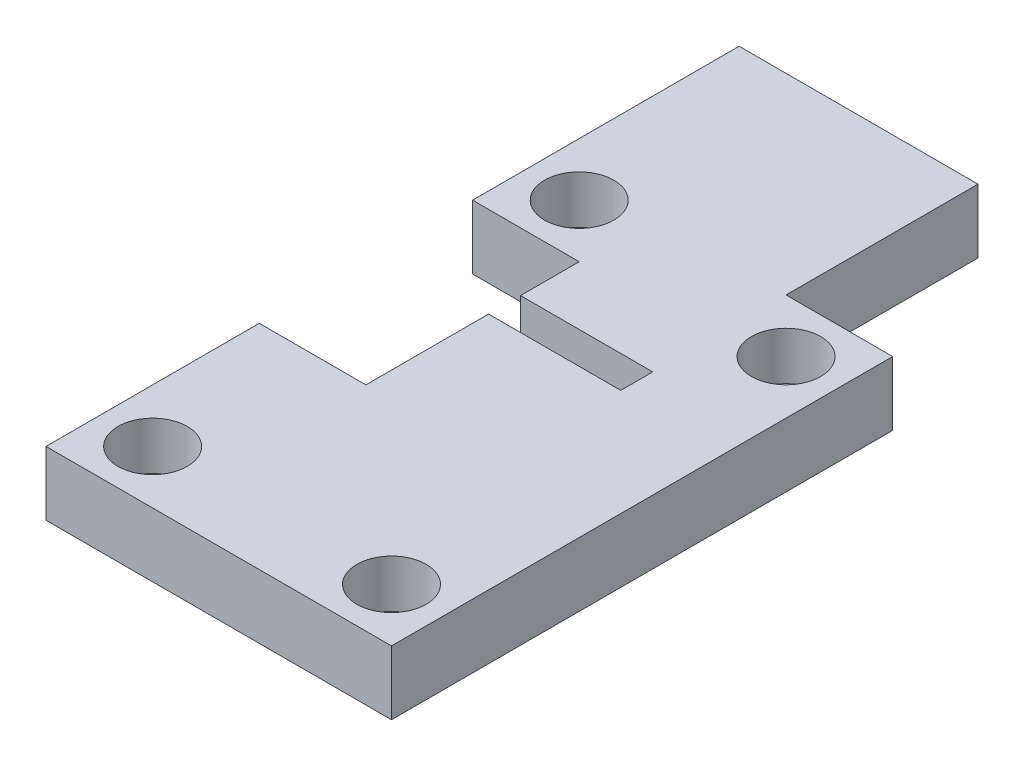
ISO-10303-21;
HEADER;
FILE_DESCRIPTION(('STEP AP214'),'2;1');
FILE_NAME('part.step','',(''),(''),'','','');
FILE_SCHEMA(('AUTOMOTIVE_DESIGN { 1 0 10303 214 1 1 1 1 }'));
ENDSEC;
DATA;
#1=APPLICATION_CONTEXT('core data for automotive mechanical design processes');
#2=APPLICATION_PROTOCOL_DEFINITION('international standard','automotive_design',2000,#1);
#3=PRODUCT_CONTEXT('',#1,'mechanical');
#4=PRODUCT('Part','Part','',(#3));
#5=PRODUCT_RELATED_PRODUCT_CATEGORY('part','',(#4));
#6=PRODUCT_DEFINITION_FORMATION('','',#4);
#7=PRODUCT_DEFINITION_CONTEXT('part definition',#1,'design');
#8=PRODUCT_DEFINITION('design','',#6,#7);
#9=PRODUCT_DEFINITION_SHAPE('','',#8);
#10=(LENGTH_UNIT() NAMED_UNIT(*) SI_UNIT(.MILLI.,.METRE.));
#11=(NAMED_UNIT(*) PLANE_ANGLE_UNIT() SI_UNIT($,.RADIAN.));
#12=(NAMED_UNIT(*) SI_UNIT($,.STERADIAN.) SOLID_ANGLE_UNIT());
#13=UNCERTAINTY_MEASURE_WITH_UNIT(LENGTH_MEASURE(1.E-05),#10,'distance_accuracy_value','');
#14=(GEOMETRIC_REPRESENTATION_CONTEXT(3) GLOBAL_UNCERTAINTY_ASSIGNED_CONTEXT((#13)) GLOBAL_UNIT_ASSIGNED_CONTEXT((#10,
#11,#12)) REPRESENTATION_CONTEXT('',''));
#15=CARTESIAN_POINT('',(0.,0.,0.));
#16=DIRECTION('',(0.,0.,1.));
#17=DIRECTION('',(1.,0.,0.));
#18=AXIS2_PLACEMENT_3D('',#15,#16,#17);
#19=CARTESIAN_POINT('',(5.,-59.,20.));
#20=DIRECTION('',(0.,1.,0.));
#21=DIRECTION('',(0.,0.,1.));
#22=AXIS2_PLACEMENT_3D('',#19,#20,#21);
#23=CYLINDRICAL_SURFACE('',#22,1.75);
#24=CARTESIAN_POINT('',(5.,0.,20.));
#25=DIRECTION('',(0.,1.,0.));
#26=DIRECTION('',(0.,0.,1.));
#27=AXIS2_PLACEMENT_3D('',#24,#25,#26);
#28=CIRCLE('',#27,1.75);
#29=CARTESIAN_POINT('',(5.,0.,21.75));
#30=VERTEX_POINT('',#29);
#31=EDGE_CURVE('E260',#30,#30,#28,.T.);
#32=ORIENTED_EDGE('',*,*,#31,.F.);
#33=EDGE_LOOP('',(#32));
#34=FACE_BOUND('',#33,.T.);
#35=CARTESIAN_POINT('',(5.,1.5,20.));
#36=DIRECTION('',(0.,1.,0.));
#37=DIRECTION('',(0.,0.,1.));
#38=AXIS2_PLACEMENT_3D('',#35,#36,#37);
#39=CIRCLE('',#38,1.75);
#40=CARTESIAN_POINT('',(5.,1.5,21.75));
#41=VERTEX_POINT('',#40);
#42=EDGE_CURVE('E37',#41,#41,#39,.F.);
#43=ORIENTED_EDGE('',*,*,#42,.F.);
#44=EDGE_LOOP('',(#43));
#45=FACE_BOUND('',#44,.T.);
#46=ADVANCED_FACE('F33',(#34,#45),#23,.F.);
#47=CARTESIAN_POINT('',(5.,-59.,60.));
#48=DIRECTION('',(0.,1.,0.));
#49=DIRECTION('',(0.,0.,1.));
#50=AXIS2_PLACEMENT_3D('',#47,#48,#49);
#51=CYLINDRICAL_SURFACE('',#50,1.75);
#52=CARTESIAN_POINT('',(5.,0.,60.));
#53=DIRECTION('',(0.,1.,0.));
#54=DIRECTION('',(0.,0.,1.));
#55=AXIS2_PLACEMENT_3D('',#52,#53,#54);
#56=CIRCLE('',#55,1.75);
#57=CARTESIAN_POINT('',(5.,0.,61.75));
#58=VERTEX_POINT('',#57);
#59=EDGE_CURVE('E263',#58,#58,#56,.T.);
#60=ORIENTED_EDGE('',*,*,#59,.F.);
#61=EDGE_LOOP('',(#60));
#62=FACE_BOUND('',#61,.T.);
#63=CARTESIAN_POINT('',(5.,1.5,60.));
#64=DIRECTION('',(0.,1.,0.));
#65=DIRECTION('',(0.,0.,1.));
#66=AXIS2_PLACEMENT_3D('',#63,#64,#65);
#67=CIRCLE('',#66,1.75);
#68=CARTESIAN_POINT('',(5.,1.5,61.75));
#69=VERTEX_POINT('',#68);
#70=EDGE_CURVE('E182',#69,#69,#67,.F.);
#71=ORIENTED_EDGE('',*,*,#70,.F.);
#72=EDGE_LOOP('',(#71));
#73=FACE_BOUND('',#72,.T.);
#74=ADVANCED_FACE('F345',(#62,#73),#51,.F.);
#75=CARTESIAN_POINT('',(27.4000000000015,-59.,60.));
#76=DIRECTION('',(0.,1.,0.));
#77=DIRECTION('',(0.,0.,1.));
#78=AXIS2_PLACEMENT_3D('',#75,#76,#77);
#79=CYLINDRICAL_SURFACE('',#78,1.75);
#80=CARTESIAN_POINT('',(27.4000000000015,0.,60.));
#81=DIRECTION('',(0.,1.,0.));
#82=DIRECTION('',(0.,0.,1.));
#83=AXIS2_PLACEMENT_3D('',#80,#81,#82);
#84=CIRCLE('',#83,1.75);
#85=CARTESIAN_POINT('',(27.4000000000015,0.,61.75));
#86=VERTEX_POINT('',#85);
#87=EDGE_CURVE('E266',#86,#86,#84,.T.);
#88=ORIENTED_EDGE('',*,*,#87,.F.);
#89=EDGE_LOOP('',(#88));
#90=FACE_BOUND('',#89,.T.);
#91=CARTESIAN_POINT('',(27.4000000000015,1.5,60.));
#92=DIRECTION('',(0.,1.,0.));
#93=DIRECTION('',(0.,0.,1.));
#94=AXIS2_PLACEMENT_3D('',#91,#92,#93);
#95=CIRCLE('',#94,1.75);
#96=CARTESIAN_POINT('',(27.4000000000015,1.5,61.75));
#97=VERTEX_POINT('',#96);
#98=EDGE_CURVE('E178',#97,#97,#95,.F.);
#99=ORIENTED_EDGE('',*,*,#98,.F.);
#100=EDGE_LOOP('',(#99));
#101=FACE_BOUND('',#100,.T.);
#102=ADVANCED_FACE('F351',(#90,#101),#79,.F.);
#103=CARTESIAN_POINT('',(27.4000000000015,-59.,23.));
#104=DIRECTION('',(0.,1.,0.));
#105=DIRECTION('',(0.,0.,1.));
#106=AXIS2_PLACEMENT_3D('',#103,#104,#105);
#107=CYLINDRICAL_SURFACE('',#106,1.75);
#108=CARTESIAN_POINT('',(27.4000000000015,0.,23.));
#109=DIRECTION('',(0.,1.,0.));
#110=DIRECTION('',(0.,0.,1.));
#111=AXIS2_PLACEMENT_3D('',#108,#109,#110);
#112=CIRCLE('',#111,1.75);
#113=CARTESIAN_POINT('',(27.4000000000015,0.,24.75));
#114=VERTEX_POINT('',#113);
#115=EDGE_CURVE('E269',#114,#114,#112,.T.);
#116=ORIENTED_EDGE('',*,*,#115,.F.);
#117=EDGE_LOOP('',(#116));
#118=FACE_BOUND('',#117,.T.);
#119=CARTESIAN_POINT('',(27.4000000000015,1.5,23.));
#120=DIRECTION('',(0.,1.,0.));
#121=DIRECTION('',(0.,0.,1.));
#122=AXIS2_PLACEMENT_3D('',#119,#120,#121);
#123=CIRCLE('',#122,1.75);
#124=CARTESIAN_POINT('',(27.4000000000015,1.5,24.75));
#125=VERTEX_POINT('',#124);
#126=EDGE_CURVE('E147',#125,#125,#123,.F.);
#127=ORIENTED_EDGE('',*,*,#126,.F.);
#128=EDGE_LOOP('',(#127));
#129=FACE_BOUND('',#128,.T.);
#130=ADVANCED_FACE('F359',(#118,#129),#107,.F.);
#131=CARTESIAN_POINT('',(0.,0.,65.));
#132=DIRECTION('',(1.,0.,0.));
#133=DIRECTION('',(0.,0.,-1.));
#134=AXIS2_PLACEMENT_3D('',#131,#132,#133);
#135=PLANE('',#134);
#136=DIRECTION('',(0.,1.,0.));
#137=VECTOR('',#136,1.);
#138=CARTESIAN_POINT('',(0.,-59.,45.));
#139=LINE('',#138,#137);
#140=CARTESIAN_POINT('',(0.,0.,45.));
#141=VERTEX_POINT('',#140);
#142=CARTESIAN_POINT('',(0.,6.,45.));
#143=VERTEX_POINT('',#142);
#144=EDGE_CURVE('E225',#141,#143,#139,.T.);
#145=ORIENTED_EDGE('',*,*,#144,.F.);
#146=DIRECTION('',(0.,0.,-1.));
#147=VECTOR('',#146,1.);
#148=CARTESIAN_POINT('',(0.,0.,65.));
#149=LINE('',#148,#147);
#150=CARTESIAN_POINT('',(0.,0.,65.));
#151=VERTEX_POINT('',#150);
#152=EDGE_CURVE('E42',#151,#141,#149,.T.);
#153=ORIENTED_EDGE('',*,*,#152,.F.);
#154=DIRECTION('',(0.,-1.,0.));
#155=VECTOR('',#154,1.);
#156=CARTESIAN_POINT('',(0.,0.,65.));
#157=LINE('',#156,#155);
#158=CARTESIAN_POINT('',(0.,6.,65.));
#159=VERTEX_POINT('',#158);
#160=EDGE_CURVE('E273',#159,#151,#157,.T.);
#161=ORIENTED_EDGE('',*,*,#160,.F.);
#162=DIRECTION('',(0.,0.,-1.));
#163=VECTOR('',#162,1.);
#164=CARTESIAN_POINT('',(0.,6.,65.));
#165=LINE('',#164,#163);
#166=EDGE_CURVE('E164',#159,#143,#165,.T.);
#167=ORIENTED_EDGE('',*,*,#166,.T.);
#168=EDGE_LOOP('',(#145,#153,#161,#167));
#169=FACE_BOUND('',#168,.T.);
#170=ADVANCED_FACE('F35',(#169),#135,.F.);
#171=DIRECTION('',(0.,1.,0.));
#172=VECTOR('',#171,1.);
#173=CARTESIAN_POINT('',(0.,-59.,25.));
#174=LINE('',#173,#172);
#175=CARTESIAN_POINT('',(0.,0.,25.));
#176=VERTEX_POINT('',#175);
#177=CARTESIAN_POINT('',(0.,6.,25.));
#178=VERTEX_POINT('',#177);
#179=EDGE_CURVE('E239',#176,#178,#174,.T.);
#180=ORIENTED_EDGE('',*,*,#179,.T.);
#181=CARTESIAN_POINT('',(0.,6.,0.));
#182=VERTEX_POINT('',#181);
#183=EDGE_CURVE('E169',#178,#182,#165,.T.);
#184=ORIENTED_EDGE('',*,*,#183,.T.);
#185=DIRECTION('',(0.,-1.,0.));
#186=VECTOR('',#185,1.);
#187=CARTESIAN_POINT('',(0.,0.,0.));
#188=LINE('',#187,#186);
#189=CARTESIAN_POINT('',(0.,0.,0.));
#190=VERTEX_POINT('',#189);
#191=EDGE_CURVE('E272',#182,#190,#188,.T.);
#192=ORIENTED_EDGE('',*,*,#191,.T.);
#193=EDGE_CURVE('E166',#176,#190,#149,.T.);
#194=ORIENTED_EDGE('',*,*,#193,.F.);
#195=EDGE_LOOP('',(#180,#184,#192,#194));
#196=FACE_BOUND('',#195,.T.);
#197=ADVANCED_FACE('F295',(#196),#135,.F.);
#198=CARTESIAN_POINT('',(0.,0.,65.));
#199=DIRECTION('',(0.,1.,0.));
#200=DIRECTION('',(0.,0.,1.));
#201=AXIS2_PLACEMENT_3D('',#198,#199,#200);
#202=PLANE('',#201);
#203=ORIENTED_EDGE('',*,*,#31,.T.);
#204=EDGE_LOOP('',(#203));
#205=FACE_BOUND('',#204,.T.);
#206=ORIENTED_EDGE('',*,*,#59,.T.);
#207=EDGE_LOOP('',(#206));
#208=FACE_BOUND('',#207,.T.);
#209=ORIENTED_EDGE('',*,*,#87,.T.);
#210=EDGE_LOOP('',(#209));
#211=FACE_BOUND('',#210,.T.);
#212=ORIENTED_EDGE('',*,*,#115,.T.);
#213=EDGE_LOOP('',(#212));
#214=FACE_BOUND('',#213,.T.);
#215=DIRECTION('',(-1.,0.,0.));
#216=VECTOR('',#215,1.);
#217=CARTESIAN_POINT('',(0.,0.,45.));
#218=LINE('',#217,#216);
#219=CARTESIAN_POINT('',(10.,0.,45.));
#220=VERTEX_POINT('',#219);
#221=EDGE_CURVE('E258',#220,#141,#218,.T.);
#222=ORIENTED_EDGE('',*,*,#221,.F.);
#223=DIRECTION('',(0.,0.,1.));
#224=VECTOR('',#223,1.);
#225=CARTESIAN_POINT('',(10.,0.,65.));
#226=LINE('',#225,#224);
#227=CARTESIAN_POINT('',(10.,0.,33.5000000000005));
#228=VERTEX_POINT('',#227);
#229=EDGE_CURVE('E256',#228,#220,#226,.T.);
#230=ORIENTED_EDGE('',*,*,#229,.F.);
#231=DIRECTION('',(-1.,0.,0.));
#232=VECTOR('',#231,1.);
#233=CARTESIAN_POINT('',(-1.14575687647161E-12,0.,33.5000000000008));
#234=LINE('',#233,#232);
#235=CARTESIAN_POINT('',(22.4000000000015,0.,33.5));
#236=VERTEX_POINT('',#235);
#237=EDGE_CURVE('E254',#236,#228,#234,.T.);
#238=ORIENTED_EDGE('',*,*,#237,.F.);
#239=DIRECTION('',(0.,0.,1.));
#240=VECTOR('',#239,1.);
#241=CARTESIAN_POINT('',(22.4000000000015,0.,65.));
#242=LINE('',#241,#240);
#243=CARTESIAN_POINT('',(22.4000000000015,0.,30.5));
#244=VERTEX_POINT('',#243);
#245=EDGE_CURVE('E252',#244,#236,#242,.T.);
#246=ORIENTED_EDGE('',*,*,#245,.F.);
#247=DIRECTION('',(1.,0.,0.));
#248=VECTOR('',#247,1.);
#249=CARTESIAN_POINT('',(0.,0.,30.5));
#250=LINE('',#249,#248);
#251=CARTESIAN_POINT('',(10.,0.,30.5));
#252=VERTEX_POINT('',#251);
#253=EDGE_CURVE('E250',#252,#244,#250,.T.);
#254=ORIENTED_EDGE('',*,*,#253,.F.);
#255=DIRECTION('',(0.,0.,1.));
#256=VECTOR('',#255,1.);
#257=CARTESIAN_POINT('',(10.,0.,65.));
#258=LINE('',#257,#256);
#259=CARTESIAN_POINT('',(10.,0.,25.));
#260=VERTEX_POINT('',#259);
#261=EDGE_CURVE('E248',#260,#252,#258,.T.);
#262=ORIENTED_EDGE('',*,*,#261,.F.);
#263=DIRECTION('',(1.,0.,0.));
#264=VECTOR('',#263,1.);
#265=CARTESIAN_POINT('',(0.,0.,25.));
#266=LINE('',#265,#264);
#267=EDGE_CURVE('E246',#176,#260,#266,.T.);
#268=ORIENTED_EDGE('',*,*,#267,.F.);
#269=ORIENTED_EDGE('',*,*,#193,.T.);
#270=DIRECTION('',(1.,0.,0.));
#271=VECTOR('',#270,1.);
#272=CARTESIAN_POINT('',(0.,0.,0.));
#273=LINE('',#272,#271);
#274=CARTESIAN_POINT('',(22.4000000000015,0.,0.));
#275=VERTEX_POINT('',#274);
#276=EDGE_CURVE('E284',#190,#275,#273,.T.);
#277=ORIENTED_EDGE('',*,*,#276,.T.);
#278=DIRECTION('',(0.,0.,-1.));
#279=VECTOR('',#278,1.);
#280=CARTESIAN_POINT('',(22.4000000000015,0.,65.));
#281=LINE('',#280,#279);
#282=CARTESIAN_POINT('',(22.4000000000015,0.,18.));
#283=VERTEX_POINT('',#282);
#284=EDGE_CURVE('E58',#283,#275,#281,.T.);
#285=ORIENTED_EDGE('',*,*,#284,.F.);
#286=DIRECTION('',(-1.,0.,0.));
#287=VECTOR('',#286,1.);
#288=CARTESIAN_POINT('',(0.,0.,18.));
#289=LINE('',#288,#287);
#290=CARTESIAN_POINT('',(32.4000000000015,0.,18.));
#291=VERTEX_POINT('',#290);
#292=EDGE_CURVE('E244',#291,#283,#289,.T.);
#293=ORIENTED_EDGE('',*,*,#292,.F.);
#294=DIRECTION('',(0.,0.,-1.));
#295=VECTOR('',#294,1.);
#296=CARTESIAN_POINT('',(32.4000000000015,0.,65.));
#297=LINE('',#296,#295);
#298=CARTESIAN_POINT('',(32.4000000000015,0.,65.));
#299=VERTEX_POINT('',#298);
#300=EDGE_CURVE('E157',#299,#291,#297,.T.);
#301=ORIENTED_EDGE('',*,*,#300,.F.);
#302=DIRECTION('',(1.,0.,0.));
#303=VECTOR('',#302,1.);
#304=CARTESIAN_POINT('',(0.,0.,65.));
#305=LINE('',#304,#303);
#306=EDGE_CURVE('E276',#151,#299,#305,.T.);
#307=ORIENTED_EDGE('',*,*,#306,.F.);
#308=ORIENTED_EDGE('',*,*,#152,.T.);
#309=EDGE_LOOP('',(#222,#230,#238,#246,#254,#262,#268,#269,#277,#285,#293,#301,#307,#308));
#310=FACE_BOUND('',#309,.T.);
#311=ADVANCED_FACE('F302',(#205,#208,#211,#214,#310),#202,.F.);
#312=CARTESIAN_POINT('',(32.4000000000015,0.,65.));
#313=DIRECTION('',(-1.,0.,0.));
#314=DIRECTION('',(0.,0.,1.));
#315=AXIS2_PLACEMENT_3D('',#312,#313,#314);
#316=PLANE('',#315);
#317=DIRECTION('',(0.,1.,0.));
#318=VECTOR('',#317,1.);
#319=CARTESIAN_POINT('',(32.4000000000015,-59.,18.));
#320=LINE('',#319,#318);
#321=CARTESIAN_POINT('',(32.4000000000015,6.,18.));
#322=VERTEX_POINT('',#321);
#323=EDGE_CURVE('E139',#291,#322,#320,.T.);
#324=ORIENTED_EDGE('',*,*,#323,.T.);
#325=DIRECTION('',(0.,0.,-1.));
#326=VECTOR('',#325,1.);
#327=CARTESIAN_POINT('',(32.4000000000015,6.,65.));
#328=LINE('',#327,#326);
#329=CARTESIAN_POINT('',(32.4000000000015,6.,65.));
#330=VERTEX_POINT('',#329);
#331=EDGE_CURVE('E154',#330,#322,#328,.T.);
#332=ORIENTED_EDGE('',*,*,#331,.F.);
#333=DIRECTION('',(0.,1.,0.));
#334=VECTOR('',#333,1.);
#335=CARTESIAN_POINT('',(32.4000000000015,0.,65.));
#336=LINE('',#335,#334);
#337=EDGE_CURVE('E279',#299,#330,#336,.T.);
#338=ORIENTED_EDGE('',*,*,#337,.F.);
#339=ORIENTED_EDGE('',*,*,#300,.T.);
#340=EDGE_LOOP('',(#324,#332,#338,#339));
#341=FACE_BOUND('',#340,.T.);
#342=ADVANCED_FACE('F152',(#341),#316,.F.);
#343=CARTESIAN_POINT('',(0.,6.,65.));
#344=DIRECTION('',(0.,-1.,0.));
#345=DIRECTION('',(0.,0.,-1.));
#346=AXIS2_PLACEMENT_3D('',#343,#344,#345);
#347=PLANE('',#346);
#348=CARTESIAN_POINT('',(5.,6.,20.));
#349=DIRECTION('',(0.,1.,0.));
#350=DIRECTION('',(0.,0.,1.));
#351=AXIS2_PLACEMENT_3D('',#348,#349,#350);
#352=CIRCLE('',#351,3.25);
#353=CARTESIAN_POINT('',(5.,6.,23.25));
#354=VERTEX_POINT('',#353);
#355=EDGE_CURVE('E198',#354,#354,#352,.T.);
#356=ORIENTED_EDGE('',*,*,#355,.F.);
#357=EDGE_LOOP('',(#356));
#358=FACE_BOUND('',#357,.T.);
#359=CARTESIAN_POINT('',(5.,6.,60.));
#360=DIRECTION('',(0.,1.,0.));
#361=DIRECTION('',(0.,0.,1.));
#362=AXIS2_PLACEMENT_3D('',#359,#360,#361);
#363=CIRCLE('',#362,3.25);
#364=CARTESIAN_POINT('',(5.,6.,63.25));
#365=VERTEX_POINT('',#364);
#366=EDGE_CURVE('E191',#365,#365,#363,.T.);
#367=ORIENTED_EDGE('',*,*,#366,.F.);
#368=EDGE_LOOP('',(#367));
#369=FACE_BOUND('',#368,.T.);
#370=CARTESIAN_POINT('',(27.4000000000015,6.,60.));
#371=DIRECTION('',(0.,1.,0.));
#372=DIRECTION('',(0.,0.,1.));
#373=AXIS2_PLACEMENT_3D('',#370,#371,#372);
#374=CIRCLE('',#373,3.25);
#375=CARTESIAN_POINT('',(27.4000000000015,6.,63.25));
#376=VERTEX_POINT('',#375);
#377=EDGE_CURVE('E184',#376,#376,#374,.T.);
#378=ORIENTED_EDGE('',*,*,#377,.F.);
#379=EDGE_LOOP('',(#378));
#380=FACE_BOUND('',#379,.T.);
#381=CARTESIAN_POINT('',(27.4000000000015,6.,23.));
#382=DIRECTION('',(0.,1.,0.));
#383=DIRECTION('',(0.,0.,1.));
#384=AXIS2_PLACEMENT_3D('',#381,#382,#383);
#385=CIRCLE('',#384,3.25);
#386=CARTESIAN_POINT('',(27.4000000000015,6.,26.25));
#387=VERTEX_POINT('',#386);
#388=EDGE_CURVE('E180',#387,#387,#385,.T.);
#389=ORIENTED_EDGE('',*,*,#388,.F.);
#390=EDGE_LOOP('',(#389));
#391=FACE_BOUND('',#390,.T.);
#392=DIRECTION('',(-1.,0.,0.));
#393=VECTOR('',#392,1.);
#394=CARTESIAN_POINT('',(0.,6.,45.));
#395=LINE('',#394,#393);
#396=CARTESIAN_POINT('',(10.,6.,45.));
#397=VERTEX_POINT('',#396);
#398=EDGE_CURVE('E158',#397,#143,#395,.T.);
#399=ORIENTED_EDGE('',*,*,#398,.T.);
#400=ORIENTED_EDGE('',*,*,#166,.F.);
#401=DIRECTION('',(-1.,0.,0.));
#402=VECTOR('',#401,1.);
#403=CARTESIAN_POINT('',(0.,6.,65.));
#404=LINE('',#403,#402);
#405=EDGE_CURVE('E163',#330,#159,#404,.T.);
#406=ORIENTED_EDGE('',*,*,#405,.F.);
#407=ORIENTED_EDGE('',*,*,#331,.T.);
#408=DIRECTION('',(-1.,0.,0.));
#409=VECTOR('',#408,1.);
#410=CARTESIAN_POINT('',(22.4000000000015,6.,18.));
#411=LINE('',#410,#409);
#412=CARTESIAN_POINT('',(22.4000000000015,6.,18.));
#413=VERTEX_POINT('',#412);
#414=EDGE_CURVE('E136',#322,#413,#411,.T.);
#415=ORIENTED_EDGE('',*,*,#414,.T.);
#416=DIRECTION('',(0.,0.,-1.));
#417=VECTOR('',#416,1.);
#418=CARTESIAN_POINT('',(22.4000000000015,6.,0.));
#419=LINE('',#418,#417);
#420=CARTESIAN_POINT('',(22.4000000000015,6.,0.));
#421=VERTEX_POINT('',#420);
#422=EDGE_CURVE('E146',#413,#421,#419,.T.);
#423=ORIENTED_EDGE('',*,*,#422,.T.);
#424=DIRECTION('',(-1.,0.,0.));
#425=VECTOR('',#424,1.);
#426=CARTESIAN_POINT('',(0.,6.,0.));
#427=LINE('',#426,#425);
#428=EDGE_CURVE('E277',#421,#182,#427,.T.);
#429=ORIENTED_EDGE('',*,*,#428,.T.);
#430=ORIENTED_EDGE('',*,*,#183,.F.);
#431=DIRECTION('',(1.,0.,0.));
#432=VECTOR('',#431,1.);
#433=CARTESIAN_POINT('',(0.,6.,25.));
#434=LINE('',#433,#432);
#435=CARTESIAN_POINT('',(10.,6.,25.));
#436=VERTEX_POINT('',#435);
#437=EDGE_CURVE('E208',#178,#436,#434,.T.);
#438=ORIENTED_EDGE('',*,*,#437,.T.);
#439=DIRECTION('',(0.,0.,1.));
#440=VECTOR('',#439,1.);
#441=CARTESIAN_POINT('',(10.,6.,30.5));
#442=LINE('',#441,#440);
#443=CARTESIAN_POINT('',(10.,6.,30.5));
#444=VERTEX_POINT('',#443);
#445=EDGE_CURVE('E50',#436,#444,#442,.T.);
#446=ORIENTED_EDGE('',*,*,#445,.T.);
#447=DIRECTION('',(1.,0.,0.));
#448=VECTOR('',#447,1.);
#449=CARTESIAN_POINT('',(10.,6.,30.5));
#450=LINE('',#449,#448);
#451=CARTESIAN_POINT('',(22.4000000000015,6.,30.5));
#452=VERTEX_POINT('',#451);
#453=EDGE_CURVE('E212',#444,#452,#450,.T.);
#454=ORIENTED_EDGE('',*,*,#453,.T.);
#455=DIRECTION('',(0.,0.,1.));
#456=VECTOR('',#455,1.);
#457=CARTESIAN_POINT('',(22.4000000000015,6.,33.5));
#458=LINE('',#457,#456);
#459=CARTESIAN_POINT('',(22.4000000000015,6.,33.5));
#460=VERTEX_POINT('',#459);
#461=EDGE_CURVE('E215',#452,#460,#458,.T.);
#462=ORIENTED_EDGE('',*,*,#461,.T.);
#463=DIRECTION('',(-1.,0.,0.));
#464=VECTOR('',#463,1.);
#465=CARTESIAN_POINT('',(10.,6.,33.5000000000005));
#466=LINE('',#465,#464);
#467=CARTESIAN_POINT('',(10.,6.,33.5000000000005));
#468=VERTEX_POINT('',#467);
#469=EDGE_CURVE('E218',#460,#468,#466,.T.);
#470=ORIENTED_EDGE('',*,*,#469,.T.);
#471=DIRECTION('',(0.,0.,1.));
#472=VECTOR('',#471,1.);
#473=CARTESIAN_POINT('',(10.,6.,45.));
#474=LINE('',#473,#472);
#475=EDGE_CURVE('E221',#468,#397,#474,.T.);
#476=ORIENTED_EDGE('',*,*,#475,.T.);
#477=EDGE_LOOP('',(#399,#400,#406,#407,#415,#423,#429,#430,#438,#446,#454,#462,#470,#476));
#478=FACE_BOUND('',#477,.T.);
#479=ADVANCED_FACE('F161',(#358,#369,#380,#391,#478),#347,.F.);
#480=CARTESIAN_POINT('',(0.,6.,0.));
#481=DIRECTION('',(0.,0.,-1.));
#482=DIRECTION('',(-1.,0.,0.));
#483=AXIS2_PLACEMENT_3D('',#480,#481,#482);
#484=PLANE('',#483);
#485=ORIENTED_EDGE('',*,*,#428,.F.);
#486=DIRECTION('',(0.,-1.,0.));
#487=VECTOR('',#486,1.);
#488=CARTESIAN_POINT('',(22.4000000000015,6.,0.));
#489=LINE('',#488,#487);
#490=EDGE_CURVE('E12',#421,#275,#489,.T.);
#491=ORIENTED_EDGE('',*,*,#490,.T.);
#492=ORIENTED_EDGE('',*,*,#276,.F.);
#493=ORIENTED_EDGE('',*,*,#191,.F.);
#494=EDGE_LOOP('',(#485,#491,#492,#493));
#495=FACE_BOUND('',#494,.T.);
#496=ADVANCED_FACE('F292',(#495),#484,.T.);
#497=CARTESIAN_POINT('',(0.,6.,65.));
#498=DIRECTION('',(0.,0.,-1.));
#499=DIRECTION('',(-1.,0.,0.));
#500=AXIS2_PLACEMENT_3D('',#497,#498,#499);
#501=PLANE('',#500);
#502=ORIENTED_EDGE('',*,*,#160,.T.);
#503=ORIENTED_EDGE('',*,*,#306,.T.);
#504=ORIENTED_EDGE('',*,*,#337,.T.);
#505=ORIENTED_EDGE('',*,*,#405,.T.);
#506=EDGE_LOOP('',(#502,#503,#504,#505));
#507=FACE_BOUND('',#506,.T.);
#508=ADVANCED_FACE('F332',(#507),#501,.F.);
#509=CARTESIAN_POINT('',(22.4000000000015,-59.,0.));
#510=DIRECTION('',(1.,0.,0.));
#511=DIRECTION('',(0.,0.,-1.));
#512=AXIS2_PLACEMENT_3D('',#509,#510,#511);
#513=PLANE('',#512);
#514=ORIENTED_EDGE('',*,*,#284,.T.);
#515=ORIENTED_EDGE('',*,*,#490,.F.);
#516=ORIENTED_EDGE('',*,*,#422,.F.);
#517=DIRECTION('',(0.,1.,0.));
#518=VECTOR('',#517,1.);
#519=CARTESIAN_POINT('',(22.4000000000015,-59.,18.));
#520=LINE('',#519,#518);
#521=EDGE_CURVE('E141',#283,#413,#520,.T.);
#522=ORIENTED_EDGE('',*,*,#521,.F.);
#523=EDGE_LOOP('',(#514,#515,#516,#522));
#524=FACE_BOUND('',#523,.T.);
#525=ADVANCED_FACE('F333',(#524),#513,.T.);
#526=CARTESIAN_POINT('',(22.4000000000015,-59.,18.));
#527=DIRECTION('',(0.,0.,-1.));
#528=DIRECTION('',(-1.,0.,0.));
#529=AXIS2_PLACEMENT_3D('',#526,#527,#528);
#530=PLANE('',#529);
#531=ORIENTED_EDGE('',*,*,#292,.T.);
#532=ORIENTED_EDGE('',*,*,#521,.T.);
#533=ORIENTED_EDGE('',*,*,#414,.F.);
#534=ORIENTED_EDGE('',*,*,#323,.F.);
#535=EDGE_LOOP('',(#531,#532,#533,#534));
#536=FACE_BOUND('',#535,.T.);
#537=ADVANCED_FACE('F138',(#536),#530,.T.);
#538=CARTESIAN_POINT('',(0.,-59.,45.));
#539=DIRECTION('',(0.,0.,-1.));
#540=DIRECTION('',(-1.,0.,0.));
#541=AXIS2_PLACEMENT_3D('',#538,#539,#540);
#542=PLANE('',#541);
#543=ORIENTED_EDGE('',*,*,#221,.T.);
#544=ORIENTED_EDGE('',*,*,#144,.T.);
#545=ORIENTED_EDGE('',*,*,#398,.F.);
#546=DIRECTION('',(0.,1.,0.));
#547=VECTOR('',#546,1.);
#548=CARTESIAN_POINT('',(10.,-59.,45.));
#549=LINE('',#548,#547);
#550=EDGE_CURVE('E227',#220,#397,#549,.T.);
#551=ORIENTED_EDGE('',*,*,#550,.F.);
#552=EDGE_LOOP('',(#543,#544,#545,#551));
#553=FACE_BOUND('',#552,.T.);
#554=ADVANCED_FACE('F340',(#553),#542,.T.);
#555=CARTESIAN_POINT('',(10.,-59.,45.));
#556=DIRECTION('',(-1.,0.,0.));
#557=DIRECTION('',(0.,0.,1.));
#558=AXIS2_PLACEMENT_3D('',#555,#556,#557);
#559=PLANE('',#558);
#560=ORIENTED_EDGE('',*,*,#229,.T.);
#561=ORIENTED_EDGE('',*,*,#550,.T.);
#562=ORIENTED_EDGE('',*,*,#475,.F.);
#563=DIRECTION('',(0.,1.,0.));
#564=VECTOR('',#563,1.);
#565=CARTESIAN_POINT('',(10.,-59.,33.5000000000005));
#566=LINE('',#565,#564);
#567=EDGE_CURVE('E229',#228,#468,#566,.T.);
#568=ORIENTED_EDGE('',*,*,#567,.F.);
#569=EDGE_LOOP('',(#560,#561,#562,#568));
#570=FACE_BOUND('',#569,.T.);
#571=ADVANCED_FACE('F323',(#570),#559,.T.);
#572=CARTESIAN_POINT('',(10.,-59.,33.5000000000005));
#573=DIRECTION('',(0.,0.,-1.));
#574=DIRECTION('',(-1.,0.,0.));
#575=AXIS2_PLACEMENT_3D('',#572,#573,#574);
#576=PLANE('',#575);
#577=ORIENTED_EDGE('',*,*,#237,.T.);
#578=ORIENTED_EDGE('',*,*,#567,.T.);
#579=ORIENTED_EDGE('',*,*,#469,.F.);
#580=DIRECTION('',(0.,1.,0.));
#581=VECTOR('',#580,1.);
#582=CARTESIAN_POINT('',(22.4000000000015,-59.,33.5));
#583=LINE('',#582,#581);
#584=EDGE_CURVE('E231',#236,#460,#583,.T.);
#585=ORIENTED_EDGE('',*,*,#584,.F.);
#586=EDGE_LOOP('',(#577,#578,#579,#585));
#587=FACE_BOUND('',#586,.T.);
#588=ADVANCED_FACE('F318',(#587),#576,.T.);
#589=CARTESIAN_POINT('',(22.4000000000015,-59.,33.5));
#590=DIRECTION('',(-1.,0.,0.));
#591=DIRECTION('',(0.,0.,1.));
#592=AXIS2_PLACEMENT_3D('',#589,#590,#591);
#593=PLANE('',#592);
#594=ORIENTED_EDGE('',*,*,#245,.T.);
#595=ORIENTED_EDGE('',*,*,#584,.T.);
#596=ORIENTED_EDGE('',*,*,#461,.F.);
#597=DIRECTION('',(0.,1.,0.));
#598=VECTOR('',#597,1.);
#599=CARTESIAN_POINT('',(22.4000000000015,-59.,30.5));
#600=LINE('',#599,#598);
#601=EDGE_CURVE('E233',#244,#452,#600,.T.);
#602=ORIENTED_EDGE('',*,*,#601,.F.);
#603=EDGE_LOOP('',(#594,#595,#596,#602));
#604=FACE_BOUND('',#603,.T.);
#605=ADVANCED_FACE('F314',(#604),#593,.T.);
#606=CARTESIAN_POINT('',(10.,-59.,30.5));
#607=DIRECTION('',(0.,0.,1.));
#608=DIRECTION('',(1.,0.,0.));
#609=AXIS2_PLACEMENT_3D('',#606,#607,#608);
#610=PLANE('',#609);
#611=ORIENTED_EDGE('',*,*,#253,.T.);
#612=ORIENTED_EDGE('',*,*,#601,.T.);
#613=ORIENTED_EDGE('',*,*,#453,.F.);
#614=DIRECTION('',(0.,1.,0.));
#615=VECTOR('',#614,1.);
#616=CARTESIAN_POINT('',(10.,-59.,30.5));
#617=LINE('',#616,#615);
#618=EDGE_CURVE('E235',#252,#444,#617,.T.);
#619=ORIENTED_EDGE('',*,*,#618,.F.);
#620=EDGE_LOOP('',(#611,#612,#613,#619));
#621=FACE_BOUND('',#620,.T.);
#622=ADVANCED_FACE('F309',(#621),#610,.T.);
#623=CARTESIAN_POINT('',(10.,-59.,30.5));
#624=DIRECTION('',(-1.,0.,0.));
#625=DIRECTION('',(0.,0.,1.));
#626=AXIS2_PLACEMENT_3D('',#623,#624,#625);
#627=PLANE('',#626);
#628=ORIENTED_EDGE('',*,*,#261,.T.);
#629=ORIENTED_EDGE('',*,*,#618,.T.);
#630=ORIENTED_EDGE('',*,*,#445,.F.);
#631=DIRECTION('',(0.,1.,0.));
#632=VECTOR('',#631,1.);
#633=CARTESIAN_POINT('',(10.,-59.,25.));
#634=LINE('',#633,#632);
#635=EDGE_CURVE('E237',#260,#436,#634,.T.);
#636=ORIENTED_EDGE('',*,*,#635,.F.);
#637=EDGE_LOOP('',(#628,#629,#630,#636));
#638=FACE_BOUND('',#637,.T.);
#639=ADVANCED_FACE('F306',(#638),#627,.T.);
#640=CARTESIAN_POINT('',(0.,-59.,25.));
#641=DIRECTION('',(0.,0.,1.));
#642=DIRECTION('',(1.,0.,0.));
#643=AXIS2_PLACEMENT_3D('',#640,#641,#642);
#644=PLANE('',#643);
#645=ORIENTED_EDGE('',*,*,#267,.T.);
#646=ORIENTED_EDGE('',*,*,#635,.T.);
#647=ORIENTED_EDGE('',*,*,#437,.F.);
#648=ORIENTED_EDGE('',*,*,#179,.F.);
#649=EDGE_LOOP('',(#645,#646,#647,#648));
#650=FACE_BOUND('',#649,.T.);
#651=ADVANCED_FACE('F298',(#650),#644,.T.);
#652=CARTESIAN_POINT('',(27.4000000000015,1.5,23.));
#653=DIRECTION('',(0.,1.,0.));
#654=DIRECTION('',(0.,0.,1.));
#655=AXIS2_PLACEMENT_3D('',#652,#653,#654);
#656=PLANE('',#655);
#657=CARTESIAN_POINT('',(27.4000000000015,1.5,23.));
#658=DIRECTION('',(0.,1.,0.));
#659=DIRECTION('',(0.,0.,1.));
#660=AXIS2_PLACEMENT_3D('',#657,#658,#659);
#661=CIRCLE('',#660,3.25);
#662=CARTESIAN_POINT('',(27.4000000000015,1.5,26.25));
#663=VERTEX_POINT('',#662);
#664=EDGE_CURVE('E177',#663,#663,#661,.T.);
#665=ORIENTED_EDGE('',*,*,#664,.T.);
#666=EDGE_LOOP('',(#665));
#667=FACE_BOUND('',#666,.T.);
#668=ORIENTED_EDGE('',*,*,#126,.T.);
#669=EDGE_LOOP('',(#668));
#670=FACE_BOUND('',#669,.T.);
#671=ADVANCED_FACE('F384',(#667,#670),#656,.T.);
#672=CARTESIAN_POINT('',(27.4000000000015,1.5,23.));
#673=DIRECTION('',(0.,1.,0.));
#674=DIRECTION('',(0.,0.,1.));
#675=AXIS2_PLACEMENT_3D('',#672,#673,#674);
#676=CYLINDRICAL_SURFACE('',#675,3.25);
#677=ORIENTED_EDGE('',*,*,#664,.F.);
#678=EDGE_LOOP('',(#677));
#679=FACE_BOUND('',#678,.T.);
#680=ORIENTED_EDGE('',*,*,#388,.T.);
#681=EDGE_LOOP('',(#680));
#682=FACE_BOUND('',#681,.T.);
#683=ADVANCED_FACE('F386',(#679,#682),#676,.F.);
#684=CARTESIAN_POINT('',(27.4000000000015,1.5,60.));
#685=DIRECTION('',(0.,1.,0.));
#686=DIRECTION('',(0.,0.,1.));
#687=AXIS2_PLACEMENT_3D('',#684,#685,#686);
#688=PLANE('',#687);
#689=CARTESIAN_POINT('',(27.4000000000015,1.5,60.));
#690=DIRECTION('',(0.,1.,0.));
#691=DIRECTION('',(0.,0.,1.));
#692=AXIS2_PLACEMENT_3D('',#689,#690,#691);
#693=CIRCLE('',#692,3.25);
#694=CARTESIAN_POINT('',(27.4000000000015,1.5,63.25));
#695=VERTEX_POINT('',#694);
#696=EDGE_CURVE('E181',#695,#695,#693,.T.);
#697=ORIENTED_EDGE('',*,*,#696,.T.);
#698=EDGE_LOOP('',(#697));
#699=FACE_BOUND('',#698,.T.);
#700=ORIENTED_EDGE('',*,*,#98,.T.);
#701=EDGE_LOOP('',(#700));
#702=FACE_BOUND('',#701,.T.);
#703=ADVANCED_FACE('F393',(#699,#702),#688,.T.);
#704=CARTESIAN_POINT('',(27.4000000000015,1.5,60.));
#705=DIRECTION('',(0.,1.,0.));
#706=DIRECTION('',(0.,0.,1.));
#707=AXIS2_PLACEMENT_3D('',#704,#705,#706);
#708=CYLINDRICAL_SURFACE('',#707,3.25);
#709=ORIENTED_EDGE('',*,*,#696,.F.);
#710=EDGE_LOOP('',(#709));
#711=FACE_BOUND('',#710,.T.);
#712=ORIENTED_EDGE('',*,*,#377,.T.);
#713=EDGE_LOOP('',(#712));
#714=FACE_BOUND('',#713,.T.);
#715=ADVANCED_FACE('F397',(#711,#714),#708,.F.);
#716=CARTESIAN_POINT('',(5.,1.5,60.));
#717=DIRECTION('',(0.,1.,0.));
#718=DIRECTION('',(0.,0.,1.));
#719=AXIS2_PLACEMENT_3D('',#716,#717,#718);
#720=PLANE('',#719);
#721=CARTESIAN_POINT('',(5.,1.5,60.));
#722=DIRECTION('',(0.,1.,0.));
#723=DIRECTION('',(0.,0.,1.));
#724=AXIS2_PLACEMENT_3D('',#721,#722,#723);
#725=CIRCLE('',#724,3.25);
#726=CARTESIAN_POINT('',(5.,1.5,63.25));
#727=VERTEX_POINT('',#726);
#728=EDGE_CURVE('E185',#727,#727,#725,.T.);
#729=ORIENTED_EDGE('',*,*,#728,.T.);
#730=EDGE_LOOP('',(#729));
#731=FACE_BOUND('',#730,.T.);
#732=ORIENTED_EDGE('',*,*,#70,.T.);
#733=EDGE_LOOP('',(#732));
#734=FACE_BOUND('',#733,.T.);
#735=ADVANCED_FACE('F477',(#731,#734),#720,.T.);
#736=CARTESIAN_POINT('',(5.,1.5,60.));
#737=DIRECTION('',(0.,1.,0.));
#738=DIRECTION('',(0.,0.,1.));
#739=AXIS2_PLACEMENT_3D('',#736,#737,#738);
#740=CYLINDRICAL_SURFACE('',#739,3.25);
#741=ORIENTED_EDGE('',*,*,#728,.F.);
#742=EDGE_LOOP('',(#741));
#743=FACE_BOUND('',#742,.T.);
#744=ORIENTED_EDGE('',*,*,#366,.T.);
#745=EDGE_LOOP('',(#744));
#746=FACE_BOUND('',#745,.T.);
#747=ADVANCED_FACE('F486',(#743,#746),#740,.F.);
#748=CARTESIAN_POINT('',(5.,1.5,20.));
#749=DIRECTION('',(0.,1.,0.));
#750=DIRECTION('',(0.,0.,1.));
#751=AXIS2_PLACEMENT_3D('',#748,#749,#750);
#752=PLANE('',#751);
#753=CARTESIAN_POINT('',(5.,1.5,20.));
#754=DIRECTION('',(0.,1.,0.));
#755=DIRECTION('',(0.,0.,1.));
#756=AXIS2_PLACEMENT_3D('',#753,#754,#755);
#757=CIRCLE('',#756,3.25);
#758=CARTESIAN_POINT('',(5.,1.5,23.25));
#759=VERTEX_POINT('',#758);
#760=EDGE_CURVE('E522',#759,#759,#757,.T.);
#761=ORIENTED_EDGE('',*,*,#760,.T.);
#762=EDGE_LOOP('',(#761));
#763=FACE_BOUND('',#762,.T.);
#764=ORIENTED_EDGE('',*,*,#42,.T.);
#765=EDGE_LOOP('',(#764));
#766=FACE_BOUND('',#765,.T.);
#767=ADVANCED_FACE('F495',(#763,#766),#752,.T.);
#768=CARTESIAN_POINT('',(5.,1.5,20.));
#769=DIRECTION('',(0.,1.,0.));
#770=DIRECTION('',(0.,0.,1.));
#771=AXIS2_PLACEMENT_3D('',#768,#769,#770);
#772=CYLINDRICAL_SURFACE('',#771,3.25);
#773=ORIENTED_EDGE('',*,*,#760,.F.);
#774=EDGE_LOOP('',(#773));
#775=FACE_BOUND('',#774,.T.);
#776=ORIENTED_EDGE('',*,*,#355,.T.);
#777=EDGE_LOOP('',(#776));
#778=FACE_BOUND('',#777,.T.);
#779=ADVANCED_FACE('F505',(#775,#778),#772,.F.);
#780=CLOSED_SHELL('',(#46,#74,#102,#130,#170,#197,#311,#342,#479,#496,#508,#525,#537,#554,#571,
#588,#605,#622,#639,#651,#671,#683,#703,#715,#735,#747,#767,#779));
#781=MANIFOLD_SOLID_BREP('B2',#780);
#782=ADVANCED_BREP_SHAPE_REPRESENTATION('',(#18,#781),#14);
#783=SHAPE_DEFINITION_REPRESENTATION(#9,#782);
ENDSEC;
END-ISO-10303-21;
